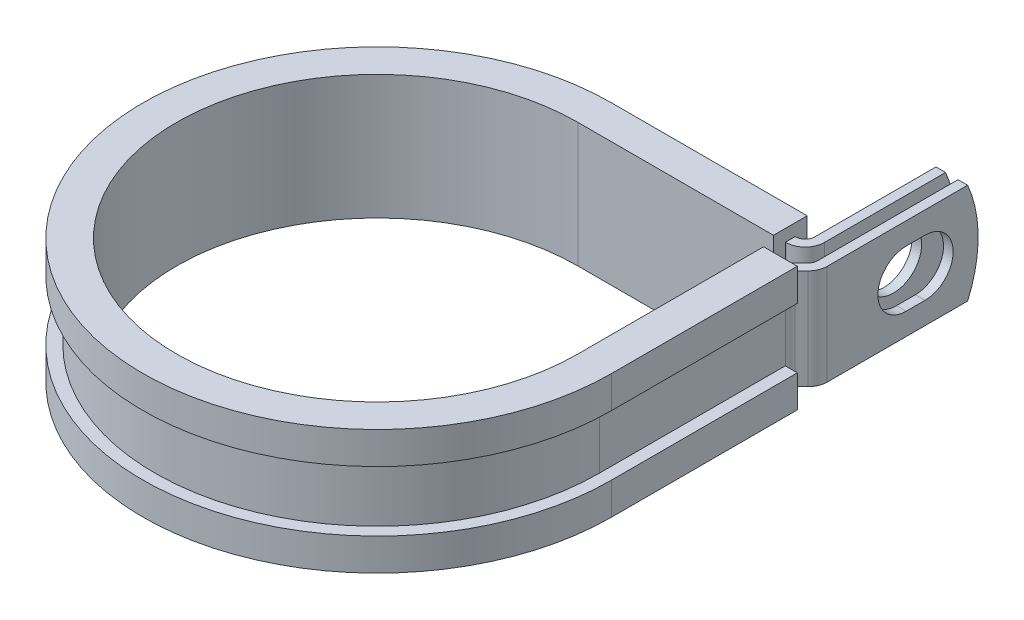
from build123d import *

# Parameters (mm, degrees)
EXTRUDE_THIN1_DEPTH = 6.35
SKETCH2_R           = 3.5687
CUT_EXTRUDE1_DEPTH  = 1.2192
CUT_EXTRUDE2_DEPTH  = 1.2192
CUT_EXTRUDE3_DEPTH  = 72.365721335


with BuildPart() as part:
    # Sketch1 → Extrude-Thin1 (new, symmetric)
    with BuildSketch(Plane(origin=(0, 0, 0), x_dir=(1, 0, 0), z_dir=(0, 1, 0))):
        with BuildLine():
            Line((28.8214698, 46.0248), (28.8214698, 26.924))
            ThreePointArc((28.8214698, 26.924), (28.728663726, 26.457432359), (28.464374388, 26.061895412))
            Line((28.464374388, 26.061895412), (27.638190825, 25.235711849))
            ThreePointArc((27.638190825, 25.235711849), (27.109612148, 24.444637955), (26.924, 23.511502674))
            Line((26.924, 23.511502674), (26.924, 0))
            ThreePointArc((26.924, 0), (-19.038142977, -19.038142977), (0, 26.924))
            Line((0, 26.924), (24.8082698, 26.924))
            ThreePointArc((24.8082698, 26.924), (26.532478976, 27.638190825), (27.2466698, 29.3624))
            Line((27.2466698, 29.3624), (27.2466698, 46.0248))
            Line((27.2466698, 46.0248), (26.0274698, 46.0248))
            Line((26.0274698, 46.0248), (26.0274698, 29.3624))
            ThreePointArc((26.0274698, 29.3624), (25.670374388, 28.500295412), (24.8082698, 28.1432))
            Line((24.8082698, 28.1432), (0, 28.1432))
            ThreePointArc((0, 28.1432), (-19.900247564, -19.900247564), (28.1432, 0))
            Line((28.1432, 0), (28.1432, 23.511502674))
            ThreePointArc((28.1432, 23.511502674), (28.236006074, 23.978070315), (28.500295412, 24.373607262))
            Line((28.500295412, 24.373607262), (29.326478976, 25.199790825))
            ThreePointArc((29.326478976, 25.199790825), (29.855057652, 25.990864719), (30.0406698, 26.924))
            Line((30.0406698, 26.924), (30.0406698, 46.0248))
            Line((30.0406698, 46.0248), (28.8214698, 46.0248))
        make_face()
    extrude(amount=EXTRUDE_THIN1_DEPTH, both=True)

    # Sketch2 → Cut-Extrude1 (cut)
    with BuildSketch(Plane.ZY.offset(-26.0274698)):
        with Locations((-38.1, 0)):
            Circle(SKETCH2_R)
    extrude(amount=-CUT_EXTRUDE1_DEPTH, mode=Mode.SUBTRACT)

    # Sketch3 → Cut-Extrude2 (cut)
    with BuildSketch(Plane(origin=(30.0406698, 0, 0), x_dir=(0, 0, -1), z_dir=(1, 0, 0))):
        with BuildLine():
            Line((36.9062, 3.5687), (39.2938, 3.5687))
            ThreePointArc((39.2938, 3.5687), (42.8625, 0), (39.2938, -3.5687))
            Line((39.2938, -3.5687), (36.9062, -3.5687))
            ThreePointArc((36.9062, -3.5687), (33.3375, 0), (36.9062, 3.5687))
        make_face()
    extrude(amount=-CUT_EXTRUDE2_DEPTH, mode=Mode.SUBTRACT)

    # Sketch4 → Cut-Extrude3 (cut, through all)
    with BuildSketch(Plane.ZY.offset(-26.0274698)):
        with BuildLine():
            Line((-44.699477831, 6.35), (-46.0248, 6.35))
            Line((-46.0248, 6.35), (-46.0248, 0))
            ThreePointArc((-46.0248, 0), (-45.689937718, 3.243415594), (-44.699477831, 6.35))
        make_face()
        with BuildLine():
            ThreePointArc((-44.699477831, -6.35), (-45.689937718, -3.243415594), (-46.0248, 0))
            Line((-46.0248, 0), (-46.0248, -6.35))
            Line((-46.0248, -6.35), (-44.699477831, -6.35))
        make_face()
    extrude(amount=-CUT_EXTRUDE3_DEPTH, mode=Mode.SUBTRACT)

    # Sweep1: sweep along a path in Sketch6
    with BuildLine(Plane(origin=(0, 6.35, 0), x_dir=(1, 0, 0), z_dir=(0, 1, 0))) as sweep1_path:
        Line((25.4, 23.511502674), (25.4, 0))
        ThreePointArc((25.4, 0), (-17.960512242, -17.960512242), (0, 25.4))
        Line((0, 25.4), (24.7574698, 25.4))
    # Sketch5 → Sweep1 (sweep)
    with BuildSketch(Plane(origin=(0, 0, -23.511502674), x_dir=(-1, 0, 0), z_dir=(0, 0, -1))):
        Polygon((-28.1432, 6.35), (-26.924, 6.35), (-26.924, -6.35), (-28.1432, -6.35), (-28.1432, -3.81), (-29.6672, -3.81), (-29.6672, -7.874), (-25.4, -7.874), (-25.4, 7.874), (-29.6672, 7.874), (-29.6672, 3.81), (-28.1432, 3.81), align=None)
    sweep(path=sweep1_path.line)


solid = part.part
